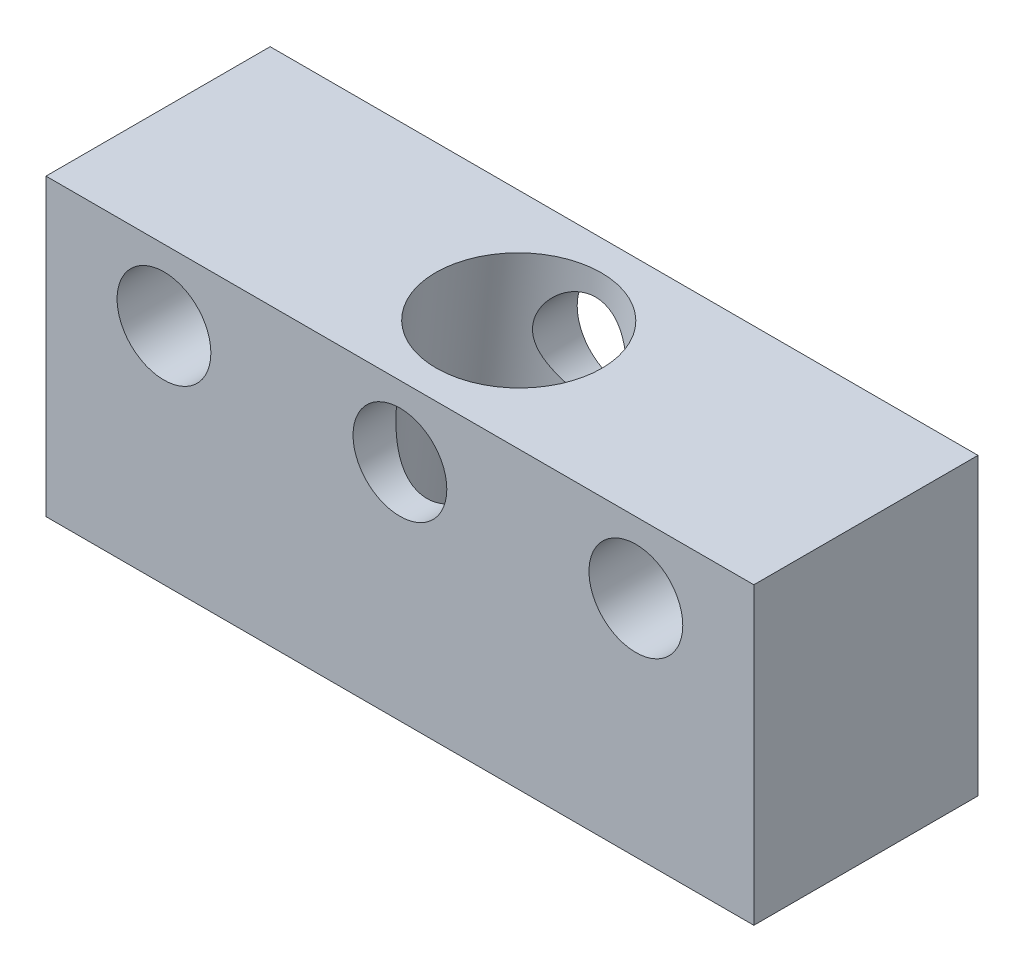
from build123d import *

# Parameters (mm, degrees)
ESQUISSE1_W          = 60
ESQUISSE1_H          = 25
ESQUISSE1_R          = 3.975
BASE_EXTRUSION_DEPTH = 19
ESQUISSE2_W          = 7
ESQUISSE2_H          = 34.447811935


with BuildPart() as part:
    # Esquisse1 → Base-Extrusion (new body)
    with BuildSketch(Plane.XY):
        with Locations((0, -6.5)):
            Rectangle(ESQUISSE1_W, ESQUISSE1_H)
        with Locations((-20, 0)):
            Circle(ESQUISSE1_R, mode=Mode.SUBTRACT)
        with Locations(Location((0, 0, 0), (0, 0, 180))):
            Circle(ESQUISSE1_R, mode=Mode.SUBTRACT)
        with Locations((20, 0)):
            Circle(ESQUISSE1_R, mode=Mode.SUBTRACT)
    extrude(amount=BASE_EXTRUSION_DEPTH)

    # Esquisse2 → Enlever de la mati_re-R_volution2 (revolve, cut)
    with BuildSketch(Plane(origin=(0, 0, 0), x_dir=(0, 0, -1), z_dir=(0.9945218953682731, -0.10452846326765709, 0)), mode=Mode.PRIVATE) as enlever_de_la_mati_re_r_volution2_sk:
        with Locations((-6.059329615, -6.776094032)):
            Rectangle(ESQUISSE2_W, ESQUISSE2_H)
    revolve(enlever_de_la_mati_re_r_volution2_sk.sketch.rotate(Axis((0.951521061, 9.053118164, 9.559329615), (-0.10452846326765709, -0.994521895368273, 0)), 90), axis=Axis((0.951521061, 9.053118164, 9.559329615), (-0.10452846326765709, -0.994521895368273, 0)), mode=Mode.SUBTRACT)


solid = part.part
